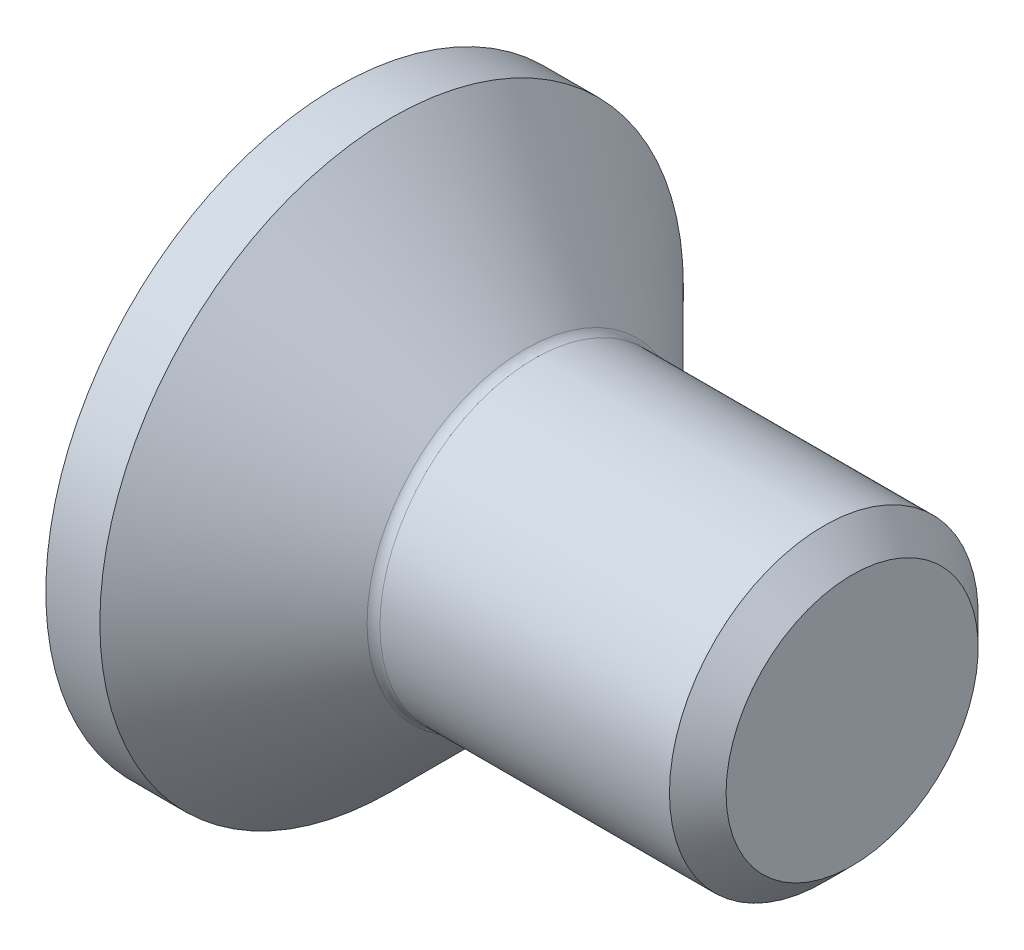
ISO-10303-21;
HEADER;
FILE_DESCRIPTION(('STEP AP214'),'2;1');
FILE_NAME('part.step','',(''),(''),'','','');
FILE_SCHEMA(('AUTOMOTIVE_DESIGN { 1 0 10303 214 1 1 1 1 }'));
ENDSEC;
DATA;
#1=APPLICATION_CONTEXT('core data for automotive mechanical design processes');
#2=APPLICATION_PROTOCOL_DEFINITION('international standard','automotive_design',2000,#1);
#3=PRODUCT_CONTEXT('',#1,'mechanical');
#4=PRODUCT('Part','Part','',(#3));
#5=PRODUCT_RELATED_PRODUCT_CATEGORY('part','',(#4));
#6=PRODUCT_DEFINITION_FORMATION('','',#4);
#7=PRODUCT_DEFINITION_CONTEXT('part definition',#1,'design');
#8=PRODUCT_DEFINITION('design','',#6,#7);
#9=PRODUCT_DEFINITION_SHAPE('','',#8);
#10=(LENGTH_UNIT() NAMED_UNIT(*) SI_UNIT(.MILLI.,.METRE.));
#11=(NAMED_UNIT(*) PLANE_ANGLE_UNIT() SI_UNIT($,.RADIAN.));
#12=(NAMED_UNIT(*) SI_UNIT($,.STERADIAN.) SOLID_ANGLE_UNIT());
#13=UNCERTAINTY_MEASURE_WITH_UNIT(LENGTH_MEASURE(1.E-05),#10,'distance_accuracy_value','');
#14=(GEOMETRIC_REPRESENTATION_CONTEXT(3) GLOBAL_UNCERTAINTY_ASSIGNED_CONTEXT((#13)) GLOBAL_UNIT_ASSIGNED_CONTEXT((#10,
#11,#12)) REPRESENTATION_CONTEXT('',''));
#15=CARTESIAN_POINT('',(0.,0.,0.));
#16=DIRECTION('',(0.,0.,1.));
#17=DIRECTION('',(1.,0.,0.));
#18=AXIS2_PLACEMENT_3D('',#15,#16,#17);
#19=CARTESIAN_POINT('',(10.,3.,0.));
#20=DIRECTION('',(-1.,0.,0.));
#21=DIRECTION('',(0.,0.,1.));
#22=AXIS2_PLACEMENT_3D('',#19,#20,#21);
#23=PLANE('',#22);
#24=CARTESIAN_POINT('',(10.,0.,0.));
#25=DIRECTION('',(-1.,0.,0.));
#26=DIRECTION('',(0.,0.,1.));
#27=AXIS2_PLACEMENT_3D('',#24,#25,#26);
#28=CIRCLE('',#27,2.45);
#29=CARTESIAN_POINT('',(10.,0.,2.45));
#30=VERTEX_POINT('',#29);
#31=EDGE_CURVE('E11',#30,#30,#28,.F.);
#32=ORIENTED_EDGE('',*,*,#31,.T.);
#33=EDGE_LOOP('',(#32));
#34=FACE_BOUND('',#33,.T.);
#35=ADVANCED_FACE('F37',(#34),#23,.F.);
#36=CARTESIAN_POINT('',(-0.587069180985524,0.,0.));
#37=DIRECTION('',(-1.,0.,0.));
#38=DIRECTION('',(0.,0.,1.));
#39=AXIS2_PLACEMENT_3D('',#36,#37,#38);
#40=CYLINDRICAL_SURFACE('',#39,3.);
#41=CARTESIAN_POINT('',(9.45,0.,0.));
#42=DIRECTION('',(-1.,0.,0.));
#43=DIRECTION('',(0.,0.,1.));
#44=AXIS2_PLACEMENT_3D('',#41,#42,#43);
#45=CIRCLE('',#44,3.);
#46=CARTESIAN_POINT('',(9.45,0.,3.));
#47=VERTEX_POINT('',#46);
#48=EDGE_CURVE('E46',#47,#47,#45,.T.);
#49=ORIENTED_EDGE('',*,*,#48,.T.);
#50=EDGE_LOOP('',(#49));
#51=FACE_BOUND('',#50,.T.);
#52=CARTESIAN_POINT('',(3.82355339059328,0.,0.));
#53=DIRECTION('',(-1.,0.,0.));
#54=DIRECTION('',(0.,0.,1.));
#55=AXIS2_PLACEMENT_3D('',#52,#53,#54);
#56=CIRCLE('',#55,3.);
#57=CARTESIAN_POINT('',(3.82355339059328,0.,3.));
#58=VERTEX_POINT('',#57);
#59=EDGE_CURVE('E150',#58,#58,#56,.F.);
#60=ORIENTED_EDGE('',*,*,#59,.T.);
#61=EDGE_LOOP('',(#60));
#62=FACE_BOUND('',#61,.T.);
#63=ADVANCED_FACE('F128',(#51,#62),#40,.T.);
#64=CARTESIAN_POINT('',(3.72,0.,0.));
#65=DIRECTION('',(-1.,0.,0.));
#66=DIRECTION('',(0.,0.,1.));
#67=AXIS2_PLACEMENT_3D('',#64,#65,#66);
#68=CONICAL_SURFACE('',#67,3.,0.785398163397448);
#69=CARTESIAN_POINT('',(1.05,0.,0.));
#70=DIRECTION('',(-1.,0.,0.));
#71=DIRECTION('',(0.,0.,1.));
#72=AXIS2_PLACEMENT_3D('',#69,#70,#71);
#73=CIRCLE('',#72,5.67);
#74=CARTESIAN_POINT('',(1.05,0.,5.67));
#75=VERTEX_POINT('',#74);
#76=EDGE_CURVE('E41',#75,#75,#73,.F.);
#77=ORIENTED_EDGE('',*,*,#76,.T.);
#78=EDGE_LOOP('',(#77));
#79=FACE_BOUND('',#78,.T.);
#80=CARTESIAN_POINT('',(3.64677669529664,0.,0.));
#81=DIRECTION('',(-1.,0.,0.));
#82=DIRECTION('',(0.,0.,1.));
#83=AXIS2_PLACEMENT_3D('',#80,#81,#82);
#84=CIRCLE('',#83,3.07322330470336);
#85=CARTESIAN_POINT('',(3.64677669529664,0.,3.07322330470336));
#86=VERTEX_POINT('',#85);
#87=EDGE_CURVE('E153',#86,#86,#84,.T.);
#88=ORIENTED_EDGE('',*,*,#87,.T.);
#89=EDGE_LOOP('',(#88));
#90=FACE_BOUND('',#89,.T.);
#91=ADVANCED_FACE('F134',(#79,#90),#68,.T.);
#92=CARTESIAN_POINT('',(3.82355339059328,0.,0.));
#93=DIRECTION('',(-1.,0.,0.));
#94=DIRECTION('',(0.,0.,1.));
#95=AXIS2_PLACEMENT_3D('',#92,#93,#94);
#96=TOROIDAL_SURFACE('',#95,3.25,0.25);
#97=ORIENTED_EDGE('',*,*,#59,.F.);
#98=EDGE_LOOP('',(#97));
#99=FACE_BOUND('',#98,.T.);
#100=ORIENTED_EDGE('',*,*,#87,.F.);
#101=EDGE_LOOP('',(#100));
#102=FACE_BOUND('',#101,.T.);
#103=ADVANCED_FACE('F138',(#99,#102),#96,.F.);
#104=CARTESIAN_POINT('',(9.45,0.,0.));
#105=DIRECTION('',(-1.,0.,0.));
#106=DIRECTION('',(0.,0.,1.));
#107=AXIS2_PLACEMENT_3D('',#104,#105,#106);
#108=CONICAL_SURFACE('',#107,3.,0.785398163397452);
#109=ORIENTED_EDGE('',*,*,#31,.F.);
#110=EDGE_LOOP('',(#109));
#111=FACE_BOUND('',#110,.T.);
#112=ORIENTED_EDGE('',*,*,#48,.F.);
#113=EDGE_LOOP('',(#112));
#114=FACE_BOUND('',#113,.T.);
#115=ADVANCED_FACE('F39',(#111,#114),#108,.T.);
#116=CARTESIAN_POINT('',(11.8531386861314,0.,0.));
#117=DIRECTION('',(1.,0.,0.));
#118=DIRECTION('',(0.,0.,-1.));
#119=AXIS2_PLACEMENT_3D('',#116,#117,#118);
#120=CYLINDRICAL_SURFACE('',#119,5.67);
#121=ORIENTED_EDGE('',*,*,#76,.F.);
#122=EDGE_LOOP('',(#121));
#123=FACE_BOUND('',#122,.T.);
#124=CARTESIAN_POINT('',(0.,0.,0.));
#125=DIRECTION('',(1.,0.,0.));
#126=DIRECTION('',(0.,0.,-1.));
#127=AXIS2_PLACEMENT_3D('',#124,#125,#126);
#128=CIRCLE('',#127,5.67);
#129=CARTESIAN_POINT('',(0.,0.,-5.67));
#130=VERTEX_POINT('',#129);
#131=EDGE_CURVE('E220',#130,#130,#128,.F.);
#132=ORIENTED_EDGE('',*,*,#131,.F.);
#133=EDGE_LOOP('',(#132));
#134=FACE_BOUND('',#133,.T.);
#135=ADVANCED_FACE('F115',(#123,#134),#120,.T.);
#136=CARTESIAN_POINT('',(2.25470053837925,0.,0.));
#137=DIRECTION('',(-1.,0.,0.));
#138=DIRECTION('',(0.,0.,1.));
#139=AXIS2_PLACEMENT_3D('',#136,#137,#138);
#140=CONICAL_SURFACE('',#139,0.,1.0471975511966);
#141=CARTESIAN_POINT('',(1.1,0.,0.));
#142=DIRECTION('',(-1.,0.,0.));
#143=DIRECTION('',(0.,0.,1.));
#144=AXIS2_PLACEMENT_3D('',#141,#142,#143);
#145=CIRCLE('',#144,2.);
#146=CARTESIAN_POINT('',(1.1,1.,1.73205080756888));
#147=VERTEX_POINT('',#146);
#148=CARTESIAN_POINT('',(1.1,2.,0.));
#149=VERTEX_POINT('',#148);
#150=EDGE_CURVE('E160',#147,#149,#145,.T.);
#151=ORIENTED_EDGE('',*,*,#150,.T.);
#152=CARTESIAN_POINT('',(1.1,1.,-1.73205080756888));
#153=VERTEX_POINT('',#152);
#154=EDGE_CURVE('E155',#149,#153,#145,.T.);
#155=ORIENTED_EDGE('',*,*,#154,.T.);
#156=CARTESIAN_POINT('',(1.1,-1.,-1.73205080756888));
#157=VERTEX_POINT('',#156);
#158=EDGE_CURVE('E158',#153,#157,#145,.T.);
#159=ORIENTED_EDGE('',*,*,#158,.T.);
#160=CARTESIAN_POINT('',(1.1,-2.,0.));
#161=VERTEX_POINT('',#160);
#162=EDGE_CURVE('E245',#157,#161,#145,.T.);
#163=ORIENTED_EDGE('',*,*,#162,.T.);
#164=CARTESIAN_POINT('',(1.1,-1.,1.73205080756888));
#165=VERTEX_POINT('',#164);
#166=EDGE_CURVE('E53',#161,#165,#145,.T.);
#167=ORIENTED_EDGE('',*,*,#166,.T.);
#168=EDGE_CURVE('E169',#165,#147,#145,.T.);
#169=ORIENTED_EDGE('',*,*,#168,.T.);
#170=EDGE_LOOP('',(#151,#155,#159,#163,#167,#169));
#171=FACE_BOUND('',#170,.T.);
#172=CARTESIAN_POINT('',(2.25470053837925,0.,0.));
#173=VERTEX_POINT('',#172);
#174=VERTEX_LOOP('',#173);
#175=FACE_BOUND('',#174,.T.);
#176=ADVANCED_FACE('F112',(#171,#175),#140,.F.);
#177=CARTESIAN_POINT('',(1.1,0.,-2.3094010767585));
#178=DIRECTION('',(1.,0.,0.));
#179=DIRECTION('',(0.,0.,-1.));
#180=AXIS2_PLACEMENT_3D('',#177,#178,#179);
#181=PLANE('',#180);
#182=ORIENTED_EDGE('',*,*,#166,.F.);
#183=DIRECTION('',(0.,0.,-1.));
#184=VECTOR('',#183,1.);
#185=CARTESIAN_POINT('',(1.1,-2.,1.15470053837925));
#186=LINE('',#185,#184);
#187=CARTESIAN_POINT('',(1.1,-2.,1.15470053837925));
#188=VERTEX_POINT('',#187);
#189=EDGE_CURVE('E180',#188,#161,#186,.T.);
#190=ORIENTED_EDGE('',*,*,#189,.F.);
#191=DIRECTION('',(0.,-0.866025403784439,-0.5));
#192=VECTOR('',#191,1.);
#193=CARTESIAN_POINT('',(1.1,0.,2.3094010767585));
#194=LINE('',#193,#192);
#195=EDGE_CURVE('E204',#165,#188,#194,.T.);
#196=ORIENTED_EDGE('',*,*,#195,.F.);
#197=EDGE_LOOP('',(#182,#190,#196));
#198=FACE_BOUND('',#197,.T.);
#199=ADVANCED_FACE('F114',(#198),#181,.F.);
#200=ORIENTED_EDGE('',*,*,#168,.F.);
#201=CARTESIAN_POINT('',(1.1,0.,2.3094010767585));
#202=VERTEX_POINT('',#201);
#203=EDGE_CURVE('E201',#202,#165,#194,.T.);
#204=ORIENTED_EDGE('',*,*,#203,.F.);
#205=DIRECTION('',(0.,-0.866025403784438,0.5));
#206=VECTOR('',#205,1.);
#207=CARTESIAN_POINT('',(1.1,2.,1.15470053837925));
#208=LINE('',#207,#206);
#209=EDGE_CURVE('E208',#147,#202,#208,.T.);
#210=ORIENTED_EDGE('',*,*,#209,.F.);
#211=EDGE_LOOP('',(#200,#204,#210));
#212=FACE_BOUND('',#211,.T.);
#213=ADVANCED_FACE('F121',(#212),#181,.F.);
#214=ORIENTED_EDGE('',*,*,#150,.F.);
#215=CARTESIAN_POINT('',(1.1,2.,1.15470053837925));
#216=VERTEX_POINT('',#215);
#217=EDGE_CURVE('E205',#216,#147,#208,.T.);
#218=ORIENTED_EDGE('',*,*,#217,.F.);
#219=DIRECTION('',(0.,0.,1.));
#220=VECTOR('',#219,1.);
#221=CARTESIAN_POINT('',(1.1,2.,-1.15470053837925));
#222=LINE('',#221,#220);
#223=EDGE_CURVE('E212',#149,#216,#222,.T.);
#224=ORIENTED_EDGE('',*,*,#223,.F.);
#225=EDGE_LOOP('',(#214,#218,#224));
#226=FACE_BOUND('',#225,.T.);
#227=ADVANCED_FACE('F276',(#226),#181,.F.);
#228=ORIENTED_EDGE('',*,*,#154,.F.);
#229=CARTESIAN_POINT('',(1.1,2.,-1.15470053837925));
#230=VERTEX_POINT('',#229);
#231=EDGE_CURVE('E209',#230,#149,#222,.T.);
#232=ORIENTED_EDGE('',*,*,#231,.F.);
#233=DIRECTION('',(0.,0.866025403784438,0.5));
#234=VECTOR('',#233,1.);
#235=CARTESIAN_POINT('',(1.1,0.,-2.3094010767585));
#236=LINE('',#235,#234);
#237=EDGE_CURVE('E216',#153,#230,#236,.T.);
#238=ORIENTED_EDGE('',*,*,#237,.F.);
#239=EDGE_LOOP('',(#228,#232,#238));
#240=FACE_BOUND('',#239,.T.);
#241=ADVANCED_FACE('F281',(#240),#181,.F.);
#242=ORIENTED_EDGE('',*,*,#158,.F.);
#243=CARTESIAN_POINT('',(1.1,0.,-2.3094010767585));
#244=VERTEX_POINT('',#243);
#245=EDGE_CURVE('E213',#244,#153,#236,.T.);
#246=ORIENTED_EDGE('',*,*,#245,.F.);
#247=DIRECTION('',(0.,0.866025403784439,-0.5));
#248=VECTOR('',#247,1.);
#249=CARTESIAN_POINT('',(1.1,-2.,-1.15470053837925));
#250=LINE('',#249,#248);
#251=EDGE_CURVE('E184',#157,#244,#250,.T.);
#252=ORIENTED_EDGE('',*,*,#251,.F.);
#253=EDGE_LOOP('',(#242,#246,#252));
#254=FACE_BOUND('',#253,.T.);
#255=ADVANCED_FACE('F250',(#254),#181,.F.);
#256=ORIENTED_EDGE('',*,*,#162,.F.);
#257=CARTESIAN_POINT('',(1.1,-2.,-1.15470053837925));
#258=VERTEX_POINT('',#257);
#259=EDGE_CURVE('E217',#258,#157,#250,.T.);
#260=ORIENTED_EDGE('',*,*,#259,.F.);
#261=EDGE_CURVE('E200',#161,#258,#186,.T.);
#262=ORIENTED_EDGE('',*,*,#261,.F.);
#263=EDGE_LOOP('',(#256,#260,#262));
#264=FACE_BOUND('',#263,.T.);
#265=ADVANCED_FACE('F124',(#264),#181,.F.);
#266=CARTESIAN_POINT('',(1.1,-2.,1.15470053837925));
#267=DIRECTION('',(0.,1.,0.));
#268=DIRECTION('',(0.,0.,1.));
#269=AXIS2_PLACEMENT_3D('',#266,#267,#268);
#270=PLANE('',#269);
#271=DIRECTION('',(0.,0.,-1.));
#272=VECTOR('',#271,1.);
#273=CARTESIAN_POINT('',(0.,-2.,1.15470053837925));
#274=LINE('',#273,#272);
#275=CARTESIAN_POINT('',(0.,-2.,1.15470053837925));
#276=VERTEX_POINT('',#275);
#277=CARTESIAN_POINT('',(0.,-2.,-1.15470053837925));
#278=VERTEX_POINT('',#277);
#279=EDGE_CURVE('E181',#276,#278,#274,.T.);
#280=ORIENTED_EDGE('',*,*,#279,.F.);
#281=DIRECTION('',(-1.,0.,0.));
#282=VECTOR('',#281,1.);
#283=CARTESIAN_POINT('',(1.1,-2.,1.15470053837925));
#284=LINE('',#283,#282);
#285=EDGE_CURVE('E176',#188,#276,#284,.T.);
#286=ORIENTED_EDGE('',*,*,#285,.F.);
#287=ORIENTED_EDGE('',*,*,#189,.T.);
#288=ORIENTED_EDGE('',*,*,#261,.T.);
#289=DIRECTION('',(-1.,0.,0.));
#290=VECTOR('',#289,1.);
#291=CARTESIAN_POINT('',(1.1,-2.,-1.15470053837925));
#292=LINE('',#291,#290);
#293=EDGE_CURVE('E178',#258,#278,#292,.T.);
#294=ORIENTED_EDGE('',*,*,#293,.T.);
#295=EDGE_LOOP('',(#280,#286,#287,#288,#294));
#296=FACE_BOUND('',#295,.T.);
#297=ADVANCED_FACE('F239',(#296),#270,.T.);
#298=CARTESIAN_POINT('',(1.1,0.,2.3094010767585));
#299=DIRECTION('',(0.,0.5,-0.866025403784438));
#300=DIRECTION('',(0.,0.866025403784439,0.5));
#301=AXIS2_PLACEMENT_3D('',#298,#299,#300);
#302=PLANE('',#301);
#303=DIRECTION('',(0.,-0.866025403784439,-0.5));
#304=VECTOR('',#303,1.);
#305=CARTESIAN_POINT('',(0.,0.,2.3094010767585));
#306=LINE('',#305,#304);
#307=CARTESIAN_POINT('',(0.,0.,2.3094010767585));
#308=VERTEX_POINT('',#307);
#309=EDGE_CURVE('E185',#308,#276,#306,.T.);
#310=ORIENTED_EDGE('',*,*,#309,.F.);
#311=DIRECTION('',(-1.,0.,0.));
#312=VECTOR('',#311,1.);
#313=CARTESIAN_POINT('',(1.1,0.,2.3094010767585));
#314=LINE('',#313,#312);
#315=EDGE_CURVE('E174',#202,#308,#314,.T.);
#316=ORIENTED_EDGE('',*,*,#315,.F.);
#317=ORIENTED_EDGE('',*,*,#203,.T.);
#318=ORIENTED_EDGE('',*,*,#195,.T.);
#319=ORIENTED_EDGE('',*,*,#285,.T.);
#320=EDGE_LOOP('',(#310,#316,#317,#318,#319));
#321=FACE_BOUND('',#320,.T.);
#322=ADVANCED_FACE('F269',(#321),#302,.T.);
#323=CARTESIAN_POINT('',(1.1,2.,1.15470053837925));
#324=DIRECTION('',(0.,-0.5,-0.866025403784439));
#325=DIRECTION('',(0.,0.866025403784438,-0.5));
#326=AXIS2_PLACEMENT_3D('',#323,#324,#325);
#327=PLANE('',#326);
#328=DIRECTION('',(0.,-0.866025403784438,0.5));
#329=VECTOR('',#328,1.);
#330=CARTESIAN_POINT('',(0.,2.,1.15470053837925));
#331=LINE('',#330,#329);
#332=CARTESIAN_POINT('',(0.,2.,1.15470053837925));
#333=VERTEX_POINT('',#332);
#334=EDGE_CURVE('E188',#333,#308,#331,.T.);
#335=ORIENTED_EDGE('',*,*,#334,.F.);
#336=DIRECTION('',(-1.,0.,0.));
#337=VECTOR('',#336,1.);
#338=CARTESIAN_POINT('',(1.1,2.,1.15470053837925));
#339=LINE('',#338,#337);
#340=EDGE_CURVE('E172',#216,#333,#339,.T.);
#341=ORIENTED_EDGE('',*,*,#340,.F.);
#342=ORIENTED_EDGE('',*,*,#217,.T.);
#343=ORIENTED_EDGE('',*,*,#209,.T.);
#344=ORIENTED_EDGE('',*,*,#315,.T.);
#345=EDGE_LOOP('',(#335,#341,#342,#343,#344));
#346=FACE_BOUND('',#345,.T.);
#347=ADVANCED_FACE('F263',(#346),#327,.T.);
#348=CARTESIAN_POINT('',(1.1,2.,-1.15470053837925));
#349=DIRECTION('',(0.,-1.,0.));
#350=DIRECTION('',(0.,0.,-1.));
#351=AXIS2_PLACEMENT_3D('',#348,#349,#350);
#352=PLANE('',#351);
#353=DIRECTION('',(0.,0.,1.));
#354=VECTOR('',#353,1.);
#355=CARTESIAN_POINT('',(0.,2.,-1.15470053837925));
#356=LINE('',#355,#354);
#357=CARTESIAN_POINT('',(0.,2.,-1.15470053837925));
#358=VERTEX_POINT('',#357);
#359=EDGE_CURVE('E191',#358,#333,#356,.T.);
#360=ORIENTED_EDGE('',*,*,#359,.F.);
#361=DIRECTION('',(-1.,0.,0.));
#362=VECTOR('',#361,1.);
#363=CARTESIAN_POINT('',(1.1,2.,-1.15470053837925));
#364=LINE('',#363,#362);
#365=EDGE_CURVE('E170',#230,#358,#364,.T.);
#366=ORIENTED_EDGE('',*,*,#365,.F.);
#367=ORIENTED_EDGE('',*,*,#231,.T.);
#368=ORIENTED_EDGE('',*,*,#223,.T.);
#369=ORIENTED_EDGE('',*,*,#340,.T.);
#370=EDGE_LOOP('',(#360,#366,#367,#368,#369));
#371=FACE_BOUND('',#370,.T.);
#372=ADVANCED_FACE('F259',(#371),#352,.T.);
#373=CARTESIAN_POINT('',(1.1,0.,-2.3094010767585));
#374=DIRECTION('',(0.,-0.5,0.866025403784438));
#375=DIRECTION('',(0.,-0.866025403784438,-0.5));
#376=AXIS2_PLACEMENT_3D('',#373,#374,#375);
#377=PLANE('',#376);
#378=DIRECTION('',(0.,0.866025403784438,0.5));
#379=VECTOR('',#378,1.);
#380=CARTESIAN_POINT('',(0.,0.,-2.3094010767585));
#381=LINE('',#380,#379);
#382=CARTESIAN_POINT('',(0.,0.,-2.3094010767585));
#383=VERTEX_POINT('',#382);
#384=EDGE_CURVE('E194',#383,#358,#381,.T.);
#385=ORIENTED_EDGE('',*,*,#384,.F.);
#386=DIRECTION('',(-1.,0.,0.));
#387=VECTOR('',#386,1.);
#388=CARTESIAN_POINT('',(1.1,0.,-2.3094010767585));
#389=LINE('',#388,#387);
#390=EDGE_CURVE('E162',#244,#383,#389,.T.);
#391=ORIENTED_EDGE('',*,*,#390,.F.);
#392=ORIENTED_EDGE('',*,*,#245,.T.);
#393=ORIENTED_EDGE('',*,*,#237,.T.);
#394=ORIENTED_EDGE('',*,*,#365,.T.);
#395=EDGE_LOOP('',(#385,#391,#392,#393,#394));
#396=FACE_BOUND('',#395,.T.);
#397=ADVANCED_FACE('F254',(#396),#377,.T.);
#398=CARTESIAN_POINT('',(1.1,-2.,-1.15470053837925));
#399=DIRECTION('',(0.,0.5,0.866025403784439));
#400=DIRECTION('',(0.,-0.866025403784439,0.5));
#401=AXIS2_PLACEMENT_3D('',#398,#399,#400);
#402=PLANE('',#401);
#403=DIRECTION('',(0.,0.866025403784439,-0.5));
#404=VECTOR('',#403,1.);
#405=CARTESIAN_POINT('',(0.,-2.,-1.15470053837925));
#406=LINE('',#405,#404);
#407=EDGE_CURVE('E61',#278,#383,#406,.T.);
#408=ORIENTED_EDGE('',*,*,#407,.F.);
#409=ORIENTED_EDGE('',*,*,#293,.F.);
#410=ORIENTED_EDGE('',*,*,#259,.T.);
#411=ORIENTED_EDGE('',*,*,#251,.T.);
#412=ORIENTED_EDGE('',*,*,#390,.T.);
#413=EDGE_LOOP('',(#408,#409,#410,#411,#412));
#414=FACE_BOUND('',#413,.T.);
#415=ADVANCED_FACE('F233',(#414),#402,.T.);
#416=CARTESIAN_POINT('',(0.,0.,0.));
#417=DIRECTION('',(1.,0.,0.));
#418=DIRECTION('',(0.,0.,-1.));
#419=AXIS2_PLACEMENT_3D('',#416,#417,#418);
#420=PLANE('',#419);
#421=ORIENTED_EDGE('',*,*,#131,.T.);
#422=EDGE_LOOP('',(#421));
#423=FACE_BOUND('',#422,.T.);
#424=ORIENTED_EDGE('',*,*,#407,.T.);
#425=ORIENTED_EDGE('',*,*,#384,.T.);
#426=ORIENTED_EDGE('',*,*,#359,.T.);
#427=ORIENTED_EDGE('',*,*,#334,.T.);
#428=ORIENTED_EDGE('',*,*,#309,.T.);
#429=ORIENTED_EDGE('',*,*,#279,.T.);
#430=EDGE_LOOP('',(#424,#425,#426,#427,#428,#429));
#431=FACE_BOUND('',#430,.T.);
#432=ADVANCED_FACE('F230',(#423,#431),#420,.F.);
#433=CLOSED_SHELL('',(#35,#63,#91,#103,#115,#135,#176,#199,#213,#227,#241,#255,#265,#297,#322,
#347,#372,#397,#415,#432));
#434=MANIFOLD_SOLID_BREP('B2',#433);
#435=ADVANCED_BREP_SHAPE_REPRESENTATION('',(#18,#434),#14);
#436=SHAPE_DEFINITION_REPRESENTATION(#9,#435);
ENDSEC;
END-ISO-10303-21;
